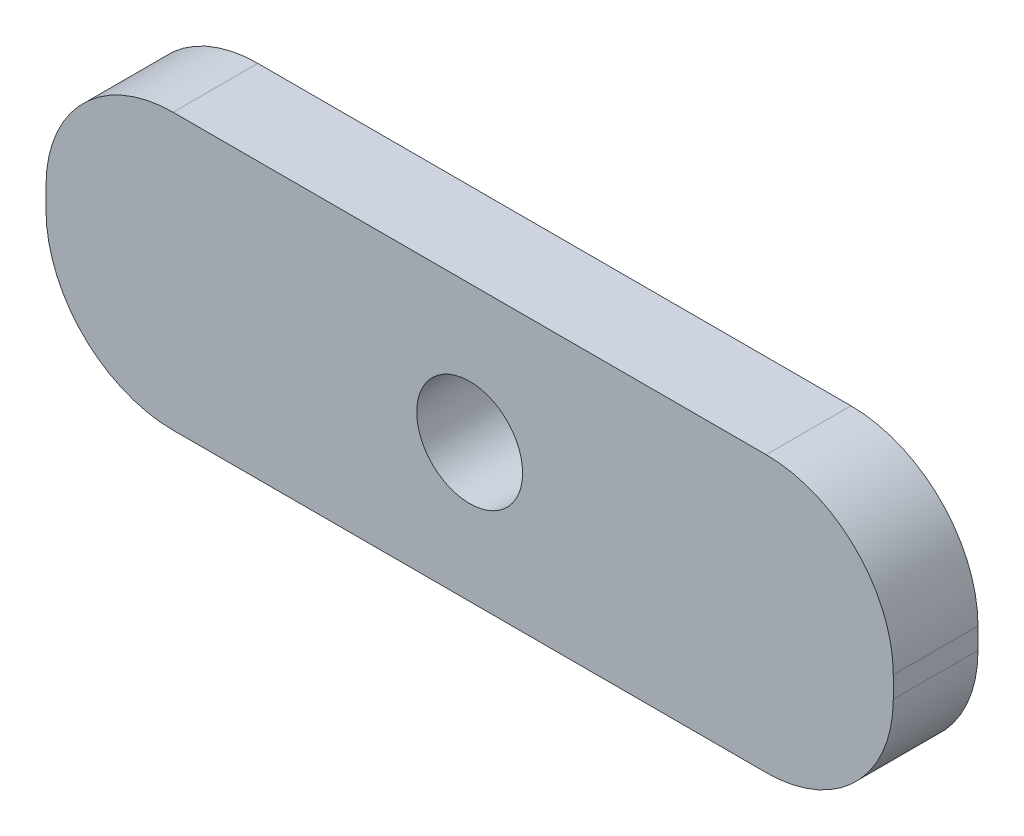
ISO-10303-21;
HEADER;
FILE_DESCRIPTION(('STEP AP214'),'2;1');
FILE_NAME('part.step','',(''),(''),'','','');
FILE_SCHEMA(('AUTOMOTIVE_DESIGN { 1 0 10303 214 1 1 1 1 }'));
ENDSEC;
DATA;
#1=APPLICATION_CONTEXT('core data for automotive mechanical design processes');
#2=APPLICATION_PROTOCOL_DEFINITION('international standard','automotive_design',2000,#1);
#3=PRODUCT_CONTEXT('',#1,'mechanical');
#4=PRODUCT('Part','Part','',(#3));
#5=PRODUCT_RELATED_PRODUCT_CATEGORY('part','',(#4));
#6=PRODUCT_DEFINITION_FORMATION('','',#4);
#7=PRODUCT_DEFINITION_CONTEXT('part definition',#1,'design');
#8=PRODUCT_DEFINITION('design','',#6,#7);
#9=PRODUCT_DEFINITION_SHAPE('','',#8);
#10=(LENGTH_UNIT() NAMED_UNIT(*) SI_UNIT(.MILLI.,.METRE.));
#11=(NAMED_UNIT(*) PLANE_ANGLE_UNIT() SI_UNIT($,.RADIAN.));
#12=(NAMED_UNIT(*) SI_UNIT($,.STERADIAN.) SOLID_ANGLE_UNIT());
#13=UNCERTAINTY_MEASURE_WITH_UNIT(LENGTH_MEASURE(1.E-05),#10,'distance_accuracy_value','');
#14=(GEOMETRIC_REPRESENTATION_CONTEXT(3) GLOBAL_UNCERTAINTY_ASSIGNED_CONTEXT((#13)) GLOBAL_UNIT_ASSIGNED_CONTEXT((#10,
#11,#12)) REPRESENTATION_CONTEXT('',''));
#15=CARTESIAN_POINT('',(0.,0.,0.));
#16=DIRECTION('',(0.,0.,1.));
#17=DIRECTION('',(1.,0.,0.));
#18=AXIS2_PLACEMENT_3D('',#15,#16,#17);
#19=CARTESIAN_POINT('',(-43.9634934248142,6.,4.));
#20=DIRECTION('',(0.,0.,-1.));
#21=DIRECTION('',(-1.,0.,0.));
#22=AXIS2_PLACEMENT_3D('',#19,#20,#21);
#23=PLANE('',#22);
#24=CARTESIAN_POINT('',(-43.9634934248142,6.,4.));
#25=DIRECTION('',(0.,0.,1.));
#26=DIRECTION('',(-1.,0.,0.));
#27=AXIS2_PLACEMENT_3D('',#24,#25,#26);
#28=CIRCLE('',#27,6.);
#29=CARTESIAN_POINT('',(-49.9634934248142,6.,4.));
#30=VERTEX_POINT('',#29);
#31=CARTESIAN_POINT('',(-43.9634934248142,0.,4.));
#32=VERTEX_POINT('',#31);
#33=EDGE_CURVE('E145',#30,#32,#28,.T.);
#34=ORIENTED_EDGE('',*,*,#33,.T.);
#35=DIRECTION('',(1.,0.,0.));
#36=VECTOR('',#35,1.);
#37=CARTESIAN_POINT('',(-43.9634934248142,0.,4.));
#38=LINE('',#37,#36);
#39=CARTESIAN_POINT('',(-15.9634934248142,0.,4.));
#40=VERTEX_POINT('',#39);
#41=EDGE_CURVE('E93',#32,#40,#38,.T.);
#42=ORIENTED_EDGE('',*,*,#41,.T.);
#43=CARTESIAN_POINT('',(-15.9634934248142,6.,4.));
#44=DIRECTION('',(0.,0.,1.));
#45=DIRECTION('',(1.,0.,0.));
#46=AXIS2_PLACEMENT_3D('',#43,#44,#45);
#47=CIRCLE('',#46,6.);
#48=CARTESIAN_POINT('',(-9.9634934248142,6.,4.));
#49=VERTEX_POINT('',#48);
#50=EDGE_CURVE('E160',#40,#49,#47,.T.);
#51=ORIENTED_EDGE('',*,*,#50,.T.);
#52=DIRECTION('',(0.,1.,0.));
#53=VECTOR('',#52,1.);
#54=CARTESIAN_POINT('',(-9.9634934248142,7.,4.));
#55=LINE('',#54,#53);
#56=CARTESIAN_POINT('',(-9.9634934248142,7.,4.));
#57=VERTEX_POINT('',#56);
#58=EDGE_CURVE('E173',#49,#57,#55,.T.);
#59=ORIENTED_EDGE('',*,*,#58,.T.);
#60=CARTESIAN_POINT('',(-15.9634934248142,7.,4.));
#61=DIRECTION('',(0.,0.,1.));
#62=DIRECTION('',(-1.,0.,0.));
#63=AXIS2_PLACEMENT_3D('',#60,#61,#62);
#64=CIRCLE('',#63,6.);
#65=CARTESIAN_POINT('',(-15.9634934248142,13.,4.));
#66=VERTEX_POINT('',#65);
#67=EDGE_CURVE('E112',#57,#66,#64,.T.);
#68=ORIENTED_EDGE('',*,*,#67,.T.);
#69=DIRECTION('',(-1.,0.,0.));
#70=VECTOR('',#69,1.);
#71=CARTESIAN_POINT('',(-43.9634934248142,13.,4.));
#72=LINE('',#71,#70);
#73=CARTESIAN_POINT('',(-43.9634934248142,13.,4.));
#74=VERTEX_POINT('',#73);
#75=EDGE_CURVE('E106',#66,#74,#72,.T.);
#76=ORIENTED_EDGE('',*,*,#75,.T.);
#77=CARTESIAN_POINT('',(-43.9634934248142,7.,4.));
#78=DIRECTION('',(0.,0.,1.));
#79=DIRECTION('',(-1.,0.,0.));
#80=AXIS2_PLACEMENT_3D('',#77,#78,#79);
#81=CIRCLE('',#80,6.);
#82=CARTESIAN_POINT('',(-49.9634934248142,7.,4.));
#83=VERTEX_POINT('',#82);
#84=EDGE_CURVE('E110',#74,#83,#81,.T.);
#85=ORIENTED_EDGE('',*,*,#84,.T.);
#86=DIRECTION('',(0.,-1.,0.));
#87=VECTOR('',#86,1.);
#88=CARTESIAN_POINT('',(-49.9634934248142,6.,4.));
#89=LINE('',#88,#87);
#90=EDGE_CURVE('E50',#83,#30,#89,.T.);
#91=ORIENTED_EDGE('',*,*,#90,.T.);
#92=EDGE_LOOP('',(#34,#42,#51,#59,#68,#76,#85,#91));
#93=FACE_BOUND('',#92,.T.);
#94=CARTESIAN_POINT('',(-29.9634934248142,6.5,4.));
#95=DIRECTION('',(0.,0.,1.));
#96=DIRECTION('',(1.,0.,0.));
#97=AXIS2_PLACEMENT_3D('',#94,#95,#96);
#98=CIRCLE('',#97,2.49999999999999);
#99=CARTESIAN_POINT('',(-27.4634934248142,6.5,4.));
#100=VERTEX_POINT('',#99);
#101=EDGE_CURVE('E134',#100,#100,#98,.T.);
#102=ORIENTED_EDGE('',*,*,#101,.F.);
#103=EDGE_LOOP('',(#102));
#104=FACE_BOUND('',#103,.T.);
#105=ADVANCED_FACE('F33',(#93,#104),#23,.F.);
#106=CARTESIAN_POINT('',(-43.9634934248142,6.,0.));
#107=DIRECTION('',(0.,0.,-1.));
#108=DIRECTION('',(-1.,0.,0.));
#109=AXIS2_PLACEMENT_3D('',#106,#107,#108);
#110=PLANE('',#109);
#111=CARTESIAN_POINT('',(-43.9634934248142,6.,0.));
#112=DIRECTION('',(0.,0.,1.));
#113=DIRECTION('',(-1.,0.,0.));
#114=AXIS2_PLACEMENT_3D('',#111,#112,#113);
#115=CIRCLE('',#114,6.);
#116=CARTESIAN_POINT('',(-49.9634934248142,6.,0.));
#117=VERTEX_POINT('',#116);
#118=CARTESIAN_POINT('',(-43.9634934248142,0.,0.));
#119=VERTEX_POINT('',#118);
#120=EDGE_CURVE('E130',#117,#119,#115,.T.);
#121=ORIENTED_EDGE('',*,*,#120,.F.);
#122=DIRECTION('',(0.,-1.,0.));
#123=VECTOR('',#122,1.);
#124=CARTESIAN_POINT('',(-49.9634934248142,6.,0.));
#125=LINE('',#124,#123);
#126=CARTESIAN_POINT('',(-49.9634934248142,7.,0.));
#127=VERTEX_POINT('',#126);
#128=EDGE_CURVE('E85',#127,#117,#125,.T.);
#129=ORIENTED_EDGE('',*,*,#128,.F.);
#130=CARTESIAN_POINT('',(-43.9634934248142,7.,0.));
#131=DIRECTION('',(0.,0.,1.));
#132=DIRECTION('',(-1.,0.,0.));
#133=AXIS2_PLACEMENT_3D('',#130,#131,#132);
#134=CIRCLE('',#133,6.);
#135=CARTESIAN_POINT('',(-43.9634934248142,13.,0.));
#136=VERTEX_POINT('',#135);
#137=EDGE_CURVE('E79',#136,#127,#134,.T.);
#138=ORIENTED_EDGE('',*,*,#137,.F.);
#139=DIRECTION('',(-1.,0.,0.));
#140=VECTOR('',#139,1.);
#141=CARTESIAN_POINT('',(-43.9634934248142,13.,0.));
#142=LINE('',#141,#140);
#143=CARTESIAN_POINT('',(-15.9634934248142,13.,0.));
#144=VERTEX_POINT('',#143);
#145=EDGE_CURVE('E120',#144,#136,#142,.T.);
#146=ORIENTED_EDGE('',*,*,#145,.F.);
#147=CARTESIAN_POINT('',(-15.9634934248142,7.,0.));
#148=DIRECTION('',(0.,0.,1.));
#149=DIRECTION('',(-1.,0.,0.));
#150=AXIS2_PLACEMENT_3D('',#147,#148,#149);
#151=CIRCLE('',#150,6.);
#152=CARTESIAN_POINT('',(-9.9634934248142,7.,0.));
#153=VERTEX_POINT('',#152);
#154=EDGE_CURVE('E140',#153,#144,#151,.T.);
#155=ORIENTED_EDGE('',*,*,#154,.F.);
#156=DIRECTION('',(0.,1.,0.));
#157=VECTOR('',#156,1.);
#158=CARTESIAN_POINT('',(-9.9634934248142,7.,0.));
#159=LINE('',#158,#157);
#160=CARTESIAN_POINT('',(-9.9634934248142,6.,0.));
#161=VERTEX_POINT('',#160);
#162=EDGE_CURVE('E138',#161,#153,#159,.T.);
#163=ORIENTED_EDGE('',*,*,#162,.F.);
#164=CARTESIAN_POINT('',(-15.9634934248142,6.,0.));
#165=DIRECTION('',(0.,0.,1.));
#166=DIRECTION('',(1.,0.,0.));
#167=AXIS2_PLACEMENT_3D('',#164,#165,#166);
#168=CIRCLE('',#167,6.);
#169=CARTESIAN_POINT('',(-15.9634934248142,0.,0.));
#170=VERTEX_POINT('',#169);
#171=EDGE_CURVE('E136',#170,#161,#168,.T.);
#172=ORIENTED_EDGE('',*,*,#171,.F.);
#173=DIRECTION('',(1.,0.,0.));
#174=VECTOR('',#173,1.);
#175=CARTESIAN_POINT('',(-43.9634934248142,0.,0.));
#176=LINE('',#175,#174);
#177=EDGE_CURVE('E133',#119,#170,#176,.T.);
#178=ORIENTED_EDGE('',*,*,#177,.F.);
#179=EDGE_LOOP('',(#121,#129,#138,#146,#155,#163,#172,#178));
#180=FACE_BOUND('',#179,.T.);
#181=CARTESIAN_POINT('',(-29.9634934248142,6.5,0.));
#182=DIRECTION('',(0.,0.,1.));
#183=DIRECTION('',(1.,0.,0.));
#184=AXIS2_PLACEMENT_3D('',#181,#182,#183);
#185=CIRCLE('',#184,2.49999999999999);
#186=CARTESIAN_POINT('',(-27.4634934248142,6.5,0.));
#187=VERTEX_POINT('',#186);
#188=EDGE_CURVE('E179',#187,#187,#185,.T.);
#189=ORIENTED_EDGE('',*,*,#188,.T.);
#190=EDGE_LOOP('',(#189));
#191=FACE_BOUND('',#190,.T.);
#192=ADVANCED_FACE('F164',(#180,#191),#110,.T.);
#193=CARTESIAN_POINT('',(-43.9634934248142,6.,4.));
#194=DIRECTION('',(0.,0.,-1.));
#195=DIRECTION('',(-1.,0.,0.));
#196=AXIS2_PLACEMENT_3D('',#193,#194,#195);
#197=CYLINDRICAL_SURFACE('',#196,6.);
#198=ORIENTED_EDGE('',*,*,#120,.T.);
#199=DIRECTION('',(0.,0.,-1.));
#200=VECTOR('',#199,1.);
#201=CARTESIAN_POINT('',(-43.9634934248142,0.,4.));
#202=LINE('',#201,#200);
#203=EDGE_CURVE('E11',#32,#119,#202,.T.);
#204=ORIENTED_EDGE('',*,*,#203,.F.);
#205=ORIENTED_EDGE('',*,*,#33,.F.);
#206=DIRECTION('',(0.,0.,-1.));
#207=VECTOR('',#206,1.);
#208=CARTESIAN_POINT('',(-49.9634934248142,6.,4.));
#209=LINE('',#208,#207);
#210=EDGE_CURVE('E126',#30,#117,#209,.T.);
#211=ORIENTED_EDGE('',*,*,#210,.T.);
#212=EDGE_LOOP('',(#198,#204,#205,#211));
#213=FACE_BOUND('',#212,.T.);
#214=ADVANCED_FACE('F35',(#213),#197,.T.);
#215=CARTESIAN_POINT('',(-43.9634934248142,0.,4.));
#216=DIRECTION('',(0.,1.,0.));
#217=DIRECTION('',(0.,0.,1.));
#218=AXIS2_PLACEMENT_3D('',#215,#216,#217);
#219=PLANE('',#218);
#220=ORIENTED_EDGE('',*,*,#177,.T.);
#221=DIRECTION('',(0.,0.,-1.));
#222=VECTOR('',#221,1.);
#223=CARTESIAN_POINT('',(-15.9634934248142,0.,4.));
#224=LINE('',#223,#222);
#225=EDGE_CURVE('E42',#40,#170,#224,.T.);
#226=ORIENTED_EDGE('',*,*,#225,.F.);
#227=ORIENTED_EDGE('',*,*,#41,.F.);
#228=ORIENTED_EDGE('',*,*,#203,.T.);
#229=EDGE_LOOP('',(#220,#226,#227,#228));
#230=FACE_BOUND('',#229,.T.);
#231=ADVANCED_FACE('F207',(#230),#219,.F.);
#232=CARTESIAN_POINT('',(-15.9634934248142,6.,4.));
#233=DIRECTION('',(0.,0.,-1.));
#234=DIRECTION('',(-1.,0.,0.));
#235=AXIS2_PLACEMENT_3D('',#232,#233,#234);
#236=CYLINDRICAL_SURFACE('',#235,6.);
#237=ORIENTED_EDGE('',*,*,#171,.T.);
#238=DIRECTION('',(0.,0.,-1.));
#239=VECTOR('',#238,1.);
#240=CARTESIAN_POINT('',(-9.9634934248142,6.,4.));
#241=LINE('',#240,#239);
#242=EDGE_CURVE('E152',#49,#161,#241,.T.);
#243=ORIENTED_EDGE('',*,*,#242,.F.);
#244=ORIENTED_EDGE('',*,*,#50,.F.);
#245=ORIENTED_EDGE('',*,*,#225,.T.);
#246=EDGE_LOOP('',(#237,#243,#244,#245));
#247=FACE_BOUND('',#246,.T.);
#248=ADVANCED_FACE('F158',(#247),#236,.T.);
#249=CARTESIAN_POINT('',(-9.9634934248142,7.,4.));
#250=DIRECTION('',(-1.,0.,0.));
#251=DIRECTION('',(0.,-1.,0.));
#252=AXIS2_PLACEMENT_3D('',#249,#250,#251);
#253=PLANE('',#252);
#254=ORIENTED_EDGE('',*,*,#162,.T.);
#255=DIRECTION('',(0.,0.,-1.));
#256=VECTOR('',#255,1.);
#257=CARTESIAN_POINT('',(-9.9634934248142,7.,4.));
#258=LINE('',#257,#256);
#259=EDGE_CURVE('E149',#57,#153,#258,.T.);
#260=ORIENTED_EDGE('',*,*,#259,.F.);
#261=ORIENTED_EDGE('',*,*,#58,.F.);
#262=ORIENTED_EDGE('',*,*,#242,.T.);
#263=EDGE_LOOP('',(#254,#260,#261,#262));
#264=FACE_BOUND('',#263,.T.);
#265=ADVANCED_FACE('F169',(#264),#253,.F.);
#266=CARTESIAN_POINT('',(-15.9634934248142,7.,4.));
#267=DIRECTION('',(0.,0.,-1.));
#268=DIRECTION('',(-1.,0.,0.));
#269=AXIS2_PLACEMENT_3D('',#266,#267,#268);
#270=CYLINDRICAL_SURFACE('',#269,6.);
#271=ORIENTED_EDGE('',*,*,#154,.T.);
#272=DIRECTION('',(0.,0.,-1.));
#273=VECTOR('',#272,1.);
#274=CARTESIAN_POINT('',(-15.9634934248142,13.,4.));
#275=LINE('',#274,#273);
#276=EDGE_CURVE('E121',#66,#144,#275,.T.);
#277=ORIENTED_EDGE('',*,*,#276,.F.);
#278=ORIENTED_EDGE('',*,*,#67,.F.);
#279=ORIENTED_EDGE('',*,*,#259,.T.);
#280=EDGE_LOOP('',(#271,#277,#278,#279));
#281=FACE_BOUND('',#280,.T.);
#282=ADVANCED_FACE('F172',(#281),#270,.T.);
#283=CARTESIAN_POINT('',(-43.9634934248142,13.,4.));
#284=DIRECTION('',(0.,-1.,0.));
#285=DIRECTION('',(0.,0.,-1.));
#286=AXIS2_PLACEMENT_3D('',#283,#284,#285);
#287=PLANE('',#286);
#288=ORIENTED_EDGE('',*,*,#145,.T.);
#289=DIRECTION('',(0.,0.,-1.));
#290=VECTOR('',#289,1.);
#291=CARTESIAN_POINT('',(-43.9634934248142,13.,4.));
#292=LINE('',#291,#290);
#293=EDGE_CURVE('E117',#74,#136,#292,.T.);
#294=ORIENTED_EDGE('',*,*,#293,.F.);
#295=ORIENTED_EDGE('',*,*,#75,.F.);
#296=ORIENTED_EDGE('',*,*,#276,.T.);
#297=EDGE_LOOP('',(#288,#294,#295,#296));
#298=FACE_BOUND('',#297,.T.);
#299=ADVANCED_FACE('F118',(#298),#287,.F.);
#300=CARTESIAN_POINT('',(-43.9634934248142,7.,4.));
#301=DIRECTION('',(0.,0.,-1.));
#302=DIRECTION('',(-1.,0.,0.));
#303=AXIS2_PLACEMENT_3D('',#300,#301,#302);
#304=CYLINDRICAL_SURFACE('',#303,6.);
#305=ORIENTED_EDGE('',*,*,#137,.T.);
#306=DIRECTION('',(0.,0.,-1.));
#307=VECTOR('',#306,1.);
#308=CARTESIAN_POINT('',(-49.9634934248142,7.,4.));
#309=LINE('',#308,#307);
#310=EDGE_CURVE('E122',#83,#127,#309,.T.);
#311=ORIENTED_EDGE('',*,*,#310,.F.);
#312=ORIENTED_EDGE('',*,*,#84,.F.);
#313=ORIENTED_EDGE('',*,*,#293,.T.);
#314=EDGE_LOOP('',(#305,#311,#312,#313));
#315=FACE_BOUND('',#314,.T.);
#316=ADVANCED_FACE('F124',(#315),#304,.T.);
#317=CARTESIAN_POINT('',(-49.9634934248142,6.,4.));
#318=DIRECTION('',(1.,0.,0.));
#319=DIRECTION('',(0.,0.,-1.));
#320=AXIS2_PLACEMENT_3D('',#317,#318,#319);
#321=PLANE('',#320);
#322=ORIENTED_EDGE('',*,*,#128,.T.);
#323=ORIENTED_EDGE('',*,*,#210,.F.);
#324=ORIENTED_EDGE('',*,*,#90,.F.);
#325=ORIENTED_EDGE('',*,*,#310,.T.);
#326=EDGE_LOOP('',(#322,#323,#324,#325));
#327=FACE_BOUND('',#326,.T.);
#328=ADVANCED_FACE('F195',(#327),#321,.F.);
#329=CARTESIAN_POINT('',(-29.9634934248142,6.5,4.));
#330=DIRECTION('',(0.,0.,-1.));
#331=DIRECTION('',(-1.,0.,0.));
#332=AXIS2_PLACEMENT_3D('',#329,#330,#331);
#333=CYLINDRICAL_SURFACE('',#332,2.49999999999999);
#334=ORIENTED_EDGE('',*,*,#101,.T.);
#335=EDGE_LOOP('',(#334));
#336=FACE_BOUND('',#335,.T.);
#337=ORIENTED_EDGE('',*,*,#188,.F.);
#338=EDGE_LOOP('',(#337));
#339=FACE_BOUND('',#338,.T.);
#340=ADVANCED_FACE('F185',(#336,#339),#333,.F.);
#341=CLOSED_SHELL('',(#105,#192,#214,#231,#248,#265,#282,#299,#316,#328,#340));
#342=MANIFOLD_SOLID_BREP('B2',#341);
#343=ADVANCED_BREP_SHAPE_REPRESENTATION('',(#18,#342),#14);
#344=SHAPE_DEFINITION_REPRESENTATION(#9,#343);
ENDSEC;
END-ISO-10303-21;
